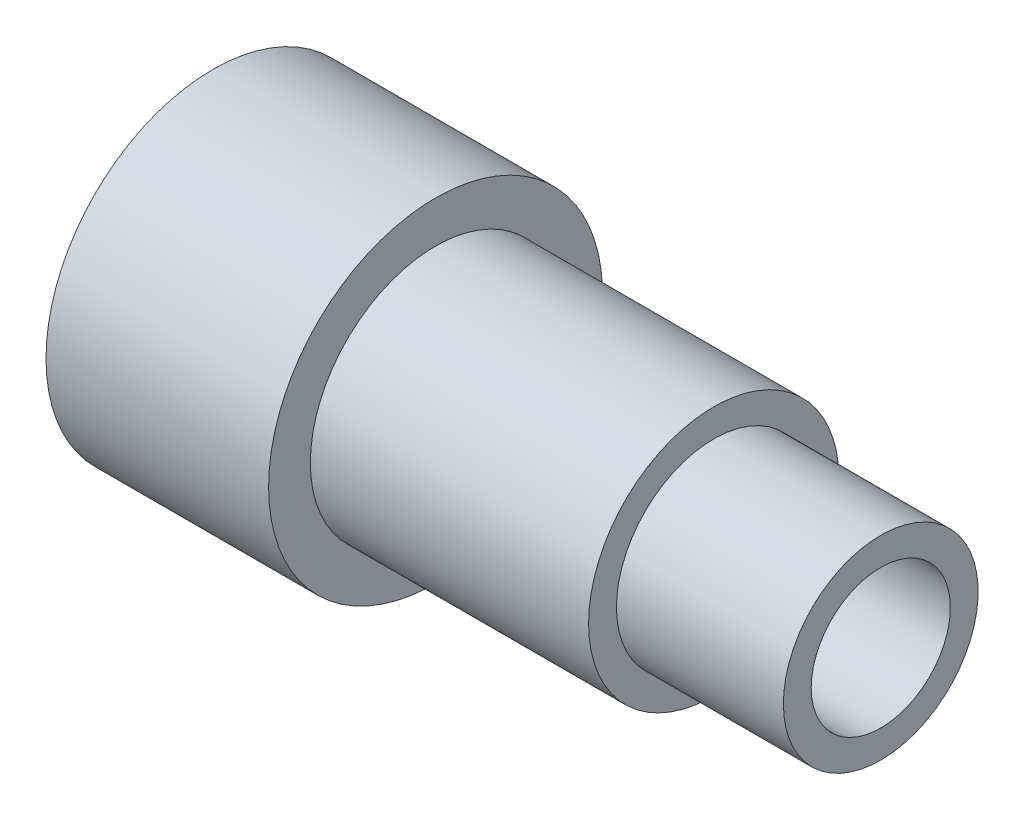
ISO-10303-21;
HEADER;
FILE_DESCRIPTION(('STEP AP214'),'2;1');
FILE_NAME('part.step','',(''),(''),'','','');
FILE_SCHEMA(('AUTOMOTIVE_DESIGN { 1 0 10303 214 1 1 1 1 }'));
ENDSEC;
DATA;
#1=APPLICATION_CONTEXT('core data for automotive mechanical design processes');
#2=APPLICATION_PROTOCOL_DEFINITION('international standard','automotive_design',2000,#1);
#3=PRODUCT_CONTEXT('',#1,'mechanical');
#4=PRODUCT('Part','Part','',(#3));
#5=PRODUCT_RELATED_PRODUCT_CATEGORY('part','',(#4));
#6=PRODUCT_DEFINITION_FORMATION('','',#4);
#7=PRODUCT_DEFINITION_CONTEXT('part definition',#1,'design');
#8=PRODUCT_DEFINITION('design','',#6,#7);
#9=PRODUCT_DEFINITION_SHAPE('','',#8);
#10=(LENGTH_UNIT() NAMED_UNIT(*) SI_UNIT(.MILLI.,.METRE.));
#11=(NAMED_UNIT(*) PLANE_ANGLE_UNIT() SI_UNIT($,.RADIAN.));
#12=(NAMED_UNIT(*) SI_UNIT($,.STERADIAN.) SOLID_ANGLE_UNIT());
#13=UNCERTAINTY_MEASURE_WITH_UNIT(LENGTH_MEASURE(1.E-05),#10,'distance_accuracy_value','');
#14=(GEOMETRIC_REPRESENTATION_CONTEXT(3) GLOBAL_UNCERTAINTY_ASSIGNED_CONTEXT((#13)) GLOBAL_UNIT_ASSIGNED_CONTEXT((#10,
#11,#12)) REPRESENTATION_CONTEXT('',''));
#15=CARTESIAN_POINT('',(0.,0.,0.));
#16=DIRECTION('',(0.,0.,1.));
#17=DIRECTION('',(1.,0.,0.));
#18=AXIS2_PLACEMENT_3D('',#15,#16,#17);
#19=CARTESIAN_POINT('',(0.,0.,0.));
#20=DIRECTION('',(-1.,0.,0.));
#21=DIRECTION('',(0.,0.,1.));
#22=AXIS2_PLACEMENT_3D('',#19,#20,#21);
#23=CYLINDRICAL_SURFACE('',#22,12.5);
#24=CARTESIAN_POINT('',(65.,-12.1346610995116,3.00000000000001));
#25=CARTESIAN_POINT('',(64.8341136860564,-12.1346643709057,2.999994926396));
#26=CARTESIAN_POINT('',(64.6681696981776,-12.1380998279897,2.9861940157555));
#27=CARTESIAN_POINT('',(64.3410316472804,-12.1514386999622,2.93143372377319));
#28=CARTESIAN_POINT('',(64.179840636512,-12.1613461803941,2.89045727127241));
#29=CARTESIAN_POINT('',(63.8669877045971,-12.1864438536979,2.78273587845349));
#30=CARTESIAN_POINT('',(63.715314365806,-12.2016275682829,2.71602252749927));
#31=CARTESIAN_POINT('',(63.4253004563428,-12.2355589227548,2.55881551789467));
#32=CARTESIAN_POINT('',(63.2869601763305,-12.2543066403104,2.46832134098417));
#33=CARTESIAN_POINT('',(63.0247311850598,-12.2936793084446,2.26416092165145));
#34=CARTESIAN_POINT('',(62.9011528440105,-12.3143323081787,2.15010136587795));
#35=CARTESIAN_POINT('',(62.6746846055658,-12.3549444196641,1.90289576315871));
#36=CARTESIAN_POINT('',(62.5717965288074,-12.3749034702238,1.7697480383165));
#37=CARTESIAN_POINT('',(62.388373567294,-12.4121875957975,1.48603435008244));
#38=CARTESIAN_POINT('',(62.3081414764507,-12.429475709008,1.33526735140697));
#39=CARTESIAN_POINT('',(62.1742734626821,-12.4591511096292,1.02190364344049));
#40=CARTESIAN_POINT('',(62.1206339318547,-12.471539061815,0.859308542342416));
#41=CARTESIAN_POINT('',(62.0424618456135,-12.4898200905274,0.530137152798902));
#42=CARTESIAN_POINT('',(62.0174027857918,-12.4958305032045,0.363692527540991));
#43=CARTESIAN_POINT('',(61.9954524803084,-12.5010873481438,0.0288605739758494));
#44=CARTESIAN_POINT('',(61.9985573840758,-12.5003347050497,-0.139526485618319));
#45=CARTESIAN_POINT('',(62.032463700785,-12.4922383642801,-0.469819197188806));
#46=CARTESIAN_POINT('',(62.0626970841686,-12.4850298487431,-0.631786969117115));
#47=CARTESIAN_POINT('',(62.1490917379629,-12.4649879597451,-0.948279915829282));
#48=CARTESIAN_POINT('',(62.2052543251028,-12.4521543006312,-1.10280471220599));
#49=CARTESIAN_POINT('',(62.3423868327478,-12.4220937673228,-1.40154850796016));
#50=CARTESIAN_POINT('',(62.4235632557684,-12.4048305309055,-1.54566890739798));
#51=CARTESIAN_POINT('',(62.6082634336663,-12.3677903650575,-1.8184437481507));
#52=CARTESIAN_POINT('',(62.7117908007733,-12.3480130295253,-1.94709568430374));
#53=CARTESIAN_POINT('',(62.9413154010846,-12.307523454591,-2.18866676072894));
#54=CARTESIAN_POINT('',(63.067809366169,-12.2868002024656,-2.30111257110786));
#55=CARTESIAN_POINT('',(63.3380756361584,-12.247210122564,-2.5032955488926));
#56=CARTESIAN_POINT('',(63.4818486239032,-12.2283433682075,-2.59303181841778));
#57=CARTESIAN_POINT('',(63.7834652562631,-12.1945661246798,-2.7475198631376));
#58=CARTESIAN_POINT('',(63.9413650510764,-12.1796724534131,-2.812165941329));
#59=CARTESIAN_POINT('',(64.2662331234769,-12.155748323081,-2.91385324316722));
#60=CARTESIAN_POINT('',(64.4331996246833,-12.1467167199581,-2.95089985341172));
#61=CARTESIAN_POINT('',(64.7670933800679,-12.1357772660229,-2.99556850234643));
#62=CARTESIAN_POINT('',(64.9339220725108,-12.1337008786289,-3.00388683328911));
#63=CARTESIAN_POINT('',(65.2665831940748,-12.1364495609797,-2.99276203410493));
#64=CARTESIAN_POINT('',(65.4324157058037,-12.1412740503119,-2.97332123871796));
#65=CARTESIAN_POINT('',(65.7558459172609,-12.1571201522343,-2.90783852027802));
#66=CARTESIAN_POINT('',(65.9135291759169,-12.1680489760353,-2.86219461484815));
#67=CARTESIAN_POINT('',(66.2190078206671,-12.1947857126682,-2.74603914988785));
#68=CARTESIAN_POINT('',(66.3668021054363,-12.2105941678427,-2.67552482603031));
#69=CARTESIAN_POINT('',(66.651278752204,-12.2456689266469,-2.51014743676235));
#70=CARTESIAN_POINT('',(66.7877093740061,-12.2649930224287,-2.41486385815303));
#71=CARTESIAN_POINT('',(67.0429007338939,-12.3047764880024,-2.20319051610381));
#72=CARTESIAN_POINT('',(67.1616588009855,-12.3252360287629,-2.08679756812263));
#73=CARTESIAN_POINT('',(67.3809150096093,-12.3655511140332,-1.8330286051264));
#74=CARTESIAN_POINT('',(67.4809337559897,-12.3853821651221,-1.69523379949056));
#75=CARTESIAN_POINT('',(67.656408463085,-12.4217193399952,-1.40439761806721));
#76=CARTESIAN_POINT('',(67.7318656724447,-12.438225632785,-1.25135701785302));
#77=CARTESIAN_POINT('',(67.855447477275,-12.4659520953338,-0.93540618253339));
#78=CARTESIAN_POINT('',(67.9037623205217,-12.4772089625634,-0.772573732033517));
#79=CARTESIAN_POINT('',(67.9722678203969,-12.4933282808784,-0.440797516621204));
#80=CARTESIAN_POINT('',(67.9924634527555,-12.4981918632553,-0.271854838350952));
#81=CARTESIAN_POINT('',(68.0038958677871,-12.5009346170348,0.0628273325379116));
#82=CARTESIAN_POINT('',(67.9958427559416,-12.4989850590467,0.228541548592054));
#83=CARTESIAN_POINT('',(67.9526200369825,-12.4886960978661,0.556181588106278));
#84=CARTESIAN_POINT('',(67.9174511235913,-12.4803568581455,0.718107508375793));
#85=CARTESIAN_POINT('',(67.8213631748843,-12.4582475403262,1.0328953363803));
#86=CARTESIAN_POINT('',(67.7605634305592,-12.4445026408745,1.18579554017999));
#87=CARTESIAN_POINT('',(67.6150497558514,-12.4130357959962,1.47930912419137));
#88=CARTESIAN_POINT('',(67.5303330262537,-12.3953133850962,1.61992106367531));
#89=CARTESIAN_POINT('',(67.3371745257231,-12.3573152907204,1.88826701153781));
#90=CARTESIAN_POINT('',(67.2282449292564,-12.3369914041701,2.0156430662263));
#91=CARTESIAN_POINT('',(66.9907123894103,-12.2963112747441,2.2505495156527));
#92=CARTESIAN_POINT('',(66.8621045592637,-12.2759550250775,2.35807496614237));
#93=CARTESIAN_POINT('',(66.5862606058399,-12.2371275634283,2.55199485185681));
#94=CARTESIAN_POINT('',(66.438747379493,-12.2186938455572,2.63800316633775));
#95=CARTESIAN_POINT('',(66.1309381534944,-12.1862909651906,2.78387070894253));
#96=CARTESIAN_POINT('',(65.9706520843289,-12.1723183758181,2.8437500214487));
#97=CARTESIAN_POINT('',(65.6754071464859,-12.1527391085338,2.92614436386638));
#98=CARTESIAN_POINT('',(65.5419291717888,-12.1460087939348,2.9537823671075));
#99=CARTESIAN_POINT('',(65.2723136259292,-12.1369686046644,2.99071161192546));
#100=CARTESIAN_POINT('',(65.136176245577,-12.1346584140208,3.00000416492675));
#101=CARTESIAN_POINT('',(65.,-12.1346610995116,3.00000000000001));
#102=B_SPLINE_CURVE_WITH_KNOTS('',3,(#24,#25,#26,#27,#28,#29,#30,#31,#32,#33,#34,#35,#36,#37,
#38,#39,#40,#41,#42,#43,#44,#45,#46,#47,#48,#49,#50,#51,#52,#53,#54,#55,#56,#57,#58,#59,#60,#61,
#62,#63,#64,#65,#66,#67,#68,#69,#70,#71,#72,#73,#74,#75,#76,#77,#78,#79,#80,#81,#82,#83,#84,#85,
#86,#87,#88,#89,#90,#91,#92,#93,#94,#95,#96,#97,#98,#99,#100,#101),.UNSPECIFIED.,.T.,.F.,(4,2,2,
2,2,2,2,2,2,2,2,2,2,2,2,2,2,2,2,2,2,2,2,2,2,2,2,2,2,2,2,2,2,2,2,2,2,2,4),(0.,0.497159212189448,
0.994631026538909,1.49149417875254,1.98836816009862,2.49432418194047,3.00032470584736,
3.51279830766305,4.02520236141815,4.5280062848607,5.03074146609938,5.52318961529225,
6.0156627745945,6.51231571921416,7.00904899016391,7.51819168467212,8.02735450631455,
8.53863957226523,9.04982482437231,9.54852995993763,10.047193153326,10.5384749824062,
11.0298114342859,11.5301065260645,12.0304771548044,12.5422844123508,13.0540656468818,
13.5622134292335,14.0702712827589,14.5656502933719,15.0610166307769,15.554102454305,
16.047246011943,16.5514085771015,17.0556965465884,17.56847227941,18.0808531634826,
18.4890008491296,18.8971193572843),.UNSPECIFIED.);
#103=CARTESIAN_POINT('',(65.,-12.1346610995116,3.00000000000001));
#104=VERTEX_POINT('',#103);
#105=EDGE_CURVE('E117',#104,#104,#102,.T.);
#106=ORIENTED_EDGE('',*,*,#105,.T.);
#107=EDGE_LOOP('',(#106));
#108=FACE_BOUND('',#107,.T.);
#109=CARTESIAN_POINT('',(120.,0.,0.));
#110=DIRECTION('',(-1.,0.,0.));
#111=DIRECTION('',(0.,0.,1.));
#112=AXIS2_PLACEMENT_3D('',#109,#110,#111);
#113=CIRCLE('',#112,12.5);
#114=CARTESIAN_POINT('',(120.,0.,12.5));
#115=VERTEX_POINT('',#114);
#116=EDGE_CURVE('E121',#115,#115,#113,.T.);
#117=ORIENTED_EDGE('',*,*,#116,.F.);
#118=EDGE_LOOP('',(#117));
#119=FACE_BOUND('',#118,.T.);
#120=CARTESIAN_POINT('',(4.,0.,0.));
#121=DIRECTION('',(1.,0.,0.));
#122=DIRECTION('',(0.,0.,-1.));
#123=AXIS2_PLACEMENT_3D('',#120,#121,#122);
#124=CIRCLE('',#123,12.5);
#125=CARTESIAN_POINT('',(4.,12.5,0.));
#126=VERTEX_POINT('',#125);
#127=CARTESIAN_POINT('',(4.,9.,-8.67467578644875));
#128=VERTEX_POINT('',#127);
#129=EDGE_CURVE('E92',#126,#128,#124,.F.);
#130=ORIENTED_EDGE('',*,*,#129,.T.);
#131=DIRECTION('',(-1.,0.,0.));
#132=VECTOR('',#131,1.);
#133=CARTESIAN_POINT('',(0.,9.,-8.67467578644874));
#134=LINE('',#133,#132);
#135=CARTESIAN_POINT('',(0.,9.,-8.67467578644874));
#136=VERTEX_POINT('',#135);
#137=EDGE_CURVE('E112',#128,#136,#134,.T.);
#138=ORIENTED_EDGE('',*,*,#137,.T.);
#139=CARTESIAN_POINT('',(0.,0.,0.));
#140=DIRECTION('',(-1.,0.,0.));
#141=DIRECTION('',(0.,0.,1.));
#142=AXIS2_PLACEMENT_3D('',#139,#140,#141);
#143=CIRCLE('',#142,12.5);
#144=CARTESIAN_POINT('',(0.,12.5,0.));
#145=VERTEX_POINT('',#144);
#146=EDGE_CURVE('E145',#136,#145,#143,.T.);
#147=ORIENTED_EDGE('',*,*,#146,.T.);
#148=DIRECTION('',(-1.,0.,0.));
#149=VECTOR('',#148,1.);
#150=CARTESIAN_POINT('',(0.,12.5,0.));
#151=LINE('',#150,#149);
#152=EDGE_CURVE('E64',#126,#145,#151,.T.);
#153=ORIENTED_EDGE('',*,*,#152,.F.);
#154=EDGE_LOOP('',(#130,#138,#147,#153));
#155=FACE_BOUND('',#154,.T.);
#156=ADVANCED_FACE('F41',(#108,#119,#155),#23,.F.);
#157=CARTESIAN_POINT('',(0.,12.5,0.));
#158=DIRECTION('',(1.,0.,0.));
#159=DIRECTION('',(0.,0.,-1.));
#160=AXIS2_PLACEMENT_3D('',#157,#158,#159);
#161=PLANE('',#160);
#162=ORIENTED_EDGE('',*,*,#146,.F.);
#163=DIRECTION('',(0.,0.,-1.));
#164=VECTOR('',#163,1.);
#165=CARTESIAN_POINT('',(0.,9.,0.));
#166=LINE('',#165,#164);
#167=CARTESIAN_POINT('',(0.,9.,-28.6181760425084));
#168=VERTEX_POINT('',#167);
#169=EDGE_CURVE('E107',#136,#168,#166,.T.);
#170=ORIENTED_EDGE('',*,*,#169,.T.);
#171=CARTESIAN_POINT('',(0.,0.,0.));
#172=DIRECTION('',(-1.,0.,0.));
#173=DIRECTION('',(0.,0.,1.));
#174=AXIS2_PLACEMENT_3D('',#171,#172,#173);
#175=CIRCLE('',#174,30.);
#176=CARTESIAN_POINT('',(0.,17.,-24.7184141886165));
#177=VERTEX_POINT('',#176);
#178=EDGE_CURVE('E174',#168,#177,#175,.T.);
#179=ORIENTED_EDGE('',*,*,#178,.T.);
#180=DIRECTION('',(0.,0.,1.));
#181=VECTOR('',#180,1.);
#182=CARTESIAN_POINT('',(0.,17.,0.));
#183=LINE('',#182,#181);
#184=CARTESIAN_POINT('',(0.,17.,0.));
#185=VERTEX_POINT('',#184);
#186=EDGE_CURVE('E57',#177,#185,#183,.T.);
#187=ORIENTED_EDGE('',*,*,#186,.T.);
#188=DIRECTION('',(0.,1.,0.));
#189=VECTOR('',#188,1.);
#190=CARTESIAN_POINT('',(0.,12.5,0.));
#191=LINE('',#190,#189);
#192=EDGE_CURVE('E11',#145,#185,#191,.T.);
#193=ORIENTED_EDGE('',*,*,#192,.F.);
#194=EDGE_LOOP('',(#162,#170,#179,#187,#193));
#195=FACE_BOUND('',#194,.T.);
#196=ADVANCED_FACE('F159',(#195),#161,.F.);
#197=CARTESIAN_POINT('',(0.,0.,0.));
#198=DIRECTION('',(-1.,0.,0.));
#199=DIRECTION('',(0.,0.,1.));
#200=AXIS2_PLACEMENT_3D('',#197,#198,#199);
#201=CYLINDRICAL_SURFACE('',#200,30.);
#202=ORIENTED_EDGE('',*,*,#178,.F.);
#203=DIRECTION('',(-1.,0.,0.));
#204=VECTOR('',#203,1.);
#205=CARTESIAN_POINT('',(0.,9.,-28.6181760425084));
#206=LINE('',#205,#204);
#207=CARTESIAN_POINT('',(4.,9.,-28.6181760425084));
#208=VERTEX_POINT('',#207);
#209=EDGE_CURVE('E47',#168,#208,#206,.F.);
#210=ORIENTED_EDGE('',*,*,#209,.T.);
#211=CARTESIAN_POINT('',(4.,0.,0.));
#212=DIRECTION('',(1.,0.,0.));
#213=DIRECTION('',(0.,0.,-1.));
#214=AXIS2_PLACEMENT_3D('',#211,#212,#213);
#215=CIRCLE('',#214,30.);
#216=CARTESIAN_POINT('',(4.,17.,-24.7184141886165));
#217=VERTEX_POINT('',#216);
#218=EDGE_CURVE('E173',#208,#217,#215,.T.);
#219=ORIENTED_EDGE('',*,*,#218,.T.);
#220=DIRECTION('',(-1.,0.,0.));
#221=VECTOR('',#220,1.);
#222=CARTESIAN_POINT('',(0.,17.,-24.7184141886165));
#223=LINE('',#222,#221);
#224=EDGE_CURVE('E99',#217,#177,#223,.T.);
#225=ORIENTED_EDGE('',*,*,#224,.T.);
#226=EDGE_LOOP('',(#202,#210,#219,#225));
#227=FACE_BOUND('',#226,.T.);
#228=CARTESIAN_POINT('',(40.,0.,0.));
#229=DIRECTION('',(-1.,0.,0.));
#230=DIRECTION('',(0.,0.,1.));
#231=AXIS2_PLACEMENT_3D('',#228,#229,#230);
#232=CIRCLE('',#231,30.);
#233=CARTESIAN_POINT('',(40.,0.,30.));
#234=VERTEX_POINT('',#233);
#235=EDGE_CURVE('E175',#234,#234,#232,.T.);
#236=ORIENTED_EDGE('',*,*,#235,.T.);
#237=EDGE_LOOP('',(#236));
#238=FACE_BOUND('',#237,.T.);
#239=ADVANCED_FACE('F160',(#227,#238),#201,.T.);
#240=CARTESIAN_POINT('',(40.,30.,0.));
#241=DIRECTION('',(-1.,0.,0.));
#242=DIRECTION('',(0.,0.,1.));
#243=AXIS2_PLACEMENT_3D('',#240,#241,#242);
#244=PLANE('',#243);
#245=ORIENTED_EDGE('',*,*,#235,.F.);
#246=EDGE_LOOP('',(#245));
#247=FACE_BOUND('',#246,.T.);
#248=CARTESIAN_POINT('',(40.,0.,0.));
#249=DIRECTION('',(-1.,0.,0.));
#250=DIRECTION('',(0.,0.,1.));
#251=AXIS2_PLACEMENT_3D('',#248,#249,#250);
#252=CIRCLE('',#251,22.5);
#253=CARTESIAN_POINT('',(40.,0.,22.5));
#254=VERTEX_POINT('',#253);
#255=EDGE_CURVE('E180',#254,#254,#252,.T.);
#256=ORIENTED_EDGE('',*,*,#255,.T.);
#257=EDGE_LOOP('',(#256));
#258=FACE_BOUND('',#257,.T.);
#259=ADVANCED_FACE('F153',(#247,#258),#244,.F.);
#260=CARTESIAN_POINT('',(0.,0.,0.));
#261=DIRECTION('',(-1.,0.,0.));
#262=DIRECTION('',(0.,0.,1.));
#263=AXIS2_PLACEMENT_3D('',#260,#261,#262);
#264=CYLINDRICAL_SURFACE('',#263,22.5);
#265=CARTESIAN_POINT('',(65.,-22.2991031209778,3.00000000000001));
#266=CARTESIAN_POINT('',(65.1677057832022,-22.2991056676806,2.99999292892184));
#267=CARTESIAN_POINT('',(65.3355140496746,-22.3010154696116,2.98588990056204));
#268=CARTESIAN_POINT('',(65.6664536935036,-22.3084447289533,2.92985694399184));
#269=CARTESIAN_POINT('',(65.8295801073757,-22.3139678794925,2.88789854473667));
#270=CARTESIAN_POINT('',(66.1463170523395,-22.3279873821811,2.777419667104));
#271=CARTESIAN_POINT('',(66.2999342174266,-22.3364816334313,2.70891795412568));
#272=CARTESIAN_POINT('',(66.5934666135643,-22.3554837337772,2.5473384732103));
#273=CARTESIAN_POINT('',(66.7333840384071,-22.3659912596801,2.45426464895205));
#274=CARTESIAN_POINT('',(66.9964601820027,-22.3879106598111,2.24555055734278));
#275=CARTESIAN_POINT('',(67.1195192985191,-22.399327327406,2.1297852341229));
#276=CARTESIAN_POINT('',(67.3445243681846,-22.4217356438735,1.87924384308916));
#277=CARTESIAN_POINT('',(67.4464692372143,-22.4327272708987,1.74446679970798));
#278=CARTESIAN_POINT('',(67.6267127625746,-22.4530964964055,1.45909758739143));
#279=CARTESIAN_POINT('',(67.7049207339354,-22.4624678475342,1.30844765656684));
#280=CARTESIAN_POINT('',(67.8348892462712,-22.4784878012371,0.996005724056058));
#281=CARTESIAN_POINT('',(67.8866508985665,-22.4851365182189,0.834214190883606));
#282=CARTESIAN_POINT('',(67.9619583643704,-22.4949282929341,0.505103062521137));
#283=CARTESIAN_POINT('',(67.985670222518,-22.4980919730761,0.337822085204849));
#284=CARTESIAN_POINT('',(68.0047199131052,-22.5006277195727,0.00162750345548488));
#285=CARTESIAN_POINT('',(68.0000590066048,-22.4999999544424,-0.167286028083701));
#286=CARTESIAN_POINT('',(67.9626279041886,-22.4950401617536,-0.500820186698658));
#287=CARTESIAN_POINT('',(67.9300363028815,-22.4907316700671,-0.665461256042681));
#288=CARTESIAN_POINT('',(67.8379485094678,-22.4789208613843,-0.986916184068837));
#289=CARTESIAN_POINT('',(67.7784517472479,-22.4714184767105,-1.14372987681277));
#290=CARTESIAN_POINT('',(67.6340548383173,-22.4540222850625,-1.4456277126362));
#291=CARTESIAN_POINT('',(67.5490780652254,-22.4441212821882,-1.59067477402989));
#292=CARTESIAN_POINT('',(67.3561891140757,-22.4230342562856,-1.86451753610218));
#293=CARTESIAN_POINT('',(67.2482757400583,-22.4118481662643,-1.99331238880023));
#294=CARTESIAN_POINT('',(67.0115782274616,-22.3893388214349,-2.23204509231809));
#295=CARTESIAN_POINT('',(66.8826383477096,-22.378015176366,-2.34182855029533));
#296=CARTESIAN_POINT('',(66.6080811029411,-22.3565924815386,-2.53822039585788));
#297=CARTESIAN_POINT('',(66.4624636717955,-22.3464934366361,-2.62482869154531));
#298=CARTESIAN_POINT('',(66.15853999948,-22.3286636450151,-2.77242429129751));
#299=CARTESIAN_POINT('',(66.0002271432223,-22.3209341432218,-2.83339813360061));
#300=CARTESIAN_POINT('',(65.6754829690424,-22.3087421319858,-2.92785135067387));
#301=CARTESIAN_POINT('',(65.5090520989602,-22.3042794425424,-2.96133224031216));
#302=CARTESIAN_POINT('',(65.1741629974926,-22.2991596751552,-2.99964241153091));
#303=CARTESIAN_POINT('',(65.0057301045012,-22.2984736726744,-3.00468946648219));
#304=CARTESIAN_POINT('',(64.6704211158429,-22.3009083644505,-2.98656432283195));
#305=CARTESIAN_POINT('',(64.5035449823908,-22.3040289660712,-2.96339281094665));
#306=CARTESIAN_POINT('',(64.1767460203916,-22.3136988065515,-2.8896720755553));
#307=CARTESIAN_POINT('',(64.0167987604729,-22.3202347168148,-2.8392292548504));
#308=CARTESIAN_POINT('',(63.7076316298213,-22.3359878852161,-2.71250767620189));
#309=CARTESIAN_POINT('',(63.5584121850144,-22.3452052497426,-2.63622789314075));
#310=CARTESIAN_POINT('',(63.2739540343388,-22.3653516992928,-2.45946609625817));
#311=CARTESIAN_POINT('',(63.1388044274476,-22.376290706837,-2.35884184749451));
#312=CARTESIAN_POINT('',(62.8872335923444,-22.3986171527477,-2.13644748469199));
#313=CARTESIAN_POINT('',(62.770813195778,-22.410004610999,-2.01467643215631));
#314=CARTESIAN_POINT('',(62.5592351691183,-22.43203422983,-1.75249132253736));
#315=CARTESIAN_POINT('',(62.4642210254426,-22.4426710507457,-1.61196096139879));
#316=CARTESIAN_POINT('',(62.299147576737,-22.4619201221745,-1.31680867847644));
#317=CARTESIAN_POINT('',(62.2290877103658,-22.4705324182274,-1.16218707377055));
#318=CARTESIAN_POINT('',(62.1161461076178,-22.4847384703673,-0.843709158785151));
#319=CARTESIAN_POINT('',(62.0731828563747,-22.4903412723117,-0.679882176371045));
#320=CARTESIAN_POINT('',(62.0153892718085,-22.4979347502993,-0.347259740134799));
#321=CARTESIAN_POINT('',(62.0005574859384,-22.499925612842,-0.178464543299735));
#322=CARTESIAN_POINT('',(61.9994775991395,-22.5000697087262,0.157904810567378));
#323=CARTESIAN_POINT('',(62.0130087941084,-22.4982525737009,0.325478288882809));
#324=CARTESIAN_POINT('',(62.067801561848,-22.4910439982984,0.655946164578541));
#325=CARTESIAN_POINT('',(62.109063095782,-22.485652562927,0.818840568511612));
#326=CARTESIAN_POINT('',(62.2180730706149,-22.4718983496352,1.13528735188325));
#327=CARTESIAN_POINT('',(62.2858094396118,-22.4635369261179,1.28884395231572));
#328=CARTESIAN_POINT('',(62.4458233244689,-22.4447662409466,1.58244611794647));
#329=CARTESIAN_POINT('',(62.5381012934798,-22.4343569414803,1.72249143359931));
#330=CARTESIAN_POINT('',(62.7453900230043,-22.4125543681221,1.98622092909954));
#331=CARTESIAN_POINT('',(62.8605646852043,-22.4011543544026,2.10977573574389));
#332=CARTESIAN_POINT('',(63.1100346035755,-22.3787079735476,2.33588843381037));
#333=CARTESIAN_POINT('',(63.2443343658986,-22.3676616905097,2.43844136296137));
#334=CARTESIAN_POINT('',(63.5289259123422,-22.3471216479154,2.62003186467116));
#335=CARTESIAN_POINT('',(63.6792853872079,-22.337634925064,2.69896410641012));
#336=CARTESIAN_POINT('',(63.9911727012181,-22.3213704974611,2.83034277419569));
#337=CARTESIAN_POINT('',(64.1526883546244,-22.3145898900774,2.8828175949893));
#338=CARTESIAN_POINT('',(64.4291724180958,-22.3061270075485,2.94743220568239));
#339=CARTESIAN_POINT('',(64.5424074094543,-22.3035064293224,2.96711622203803));
#340=CARTESIAN_POINT('',(64.7704122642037,-22.2999936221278,2.99340248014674));
#341=CARTESIAN_POINT('',(64.8851821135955,-22.2991013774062,3.00000484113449));
#342=CARTESIAN_POINT('',(65.,-22.2991031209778,3.00000000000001));
#343=B_SPLINE_CURVE_WITH_KNOTS('',3,(#265,#266,#267,#268,#269,#270,#271,#272,#273,#274,#275,
#276,#277,#278,#279,#280,#281,#282,#283,#284,#285,#286,#287,#288,#289,#290,#291,#292,#293,#294,
#295,#296,#297,#298,#299,#300,#301,#302,#303,#304,#305,#306,#307,#308,#309,#310,#311,#312,#313,
#314,#315,#316,#317,#318,#319,#320,#321,#322,#323,#324,#325,#326,#327,#328,#329,#330,#331,#332,
#333,#334,#335,#336,#337,#338,#339,#340,#341,#342),.UNSPECIFIED.,.T.,.F.,(4,2,2,2,2,2,2,2,2,2,2,
2,2,2,2,2,2,2,2,2,2,2,2,2,2,2,2,2,2,2,2,2,2,2,2,2,2,2,4),(0.,0.502697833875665,1.00591026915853,
1.50876759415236,2.01154426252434,2.51717392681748,3.02282954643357,3.5303933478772,
4.03793581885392,4.54245854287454,5.04695884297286,5.5482571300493,6.04956604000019,
6.55239792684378,7.05525603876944,7.56202372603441,8.06879342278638,8.57582891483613,
9.08283646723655,9.58595553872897,10.0890623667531,10.5902202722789,11.0913980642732,
11.595577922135,12.0997801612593,12.6072676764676,13.1147437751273,13.6206858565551,
14.1266018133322,14.6285956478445,15.1305887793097,15.632353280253,16.1341270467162,
16.6396311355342,17.1452545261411,17.6531001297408,18.160399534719,18.5045691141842,
18.8487355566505),.UNSPECIFIED.);
#344=CARTESIAN_POINT('',(65.,-22.2991031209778,3.00000000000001));
#345=VERTEX_POINT('',#344);
#346=EDGE_CURVE('E116',#345,#345,#343,.T.);
#347=ORIENTED_EDGE('',*,*,#346,.T.);
#348=EDGE_LOOP('',(#347));
#349=FACE_BOUND('',#348,.T.);
#350=ORIENTED_EDGE('',*,*,#255,.F.);
#351=EDGE_LOOP('',(#350));
#352=FACE_BOUND('',#351,.T.);
#353=CARTESIAN_POINT('',(90.,0.,0.));
#354=DIRECTION('',(-1.,0.,0.));
#355=DIRECTION('',(0.,0.,1.));
#356=AXIS2_PLACEMENT_3D('',#353,#354,#355);
#357=CIRCLE('',#356,22.5);
#358=CARTESIAN_POINT('',(90.,0.,22.5));
#359=VERTEX_POINT('',#358);
#360=EDGE_CURVE('E185',#359,#359,#357,.T.);
#361=ORIENTED_EDGE('',*,*,#360,.T.);
#362=EDGE_LOOP('',(#361));
#363=FACE_BOUND('',#362,.T.);
#364=ADVANCED_FACE('F150',(#349,#352,#363),#264,.T.);
#365=CARTESIAN_POINT('',(90.,22.5,0.));
#366=DIRECTION('',(-1.,0.,0.));
#367=DIRECTION('',(0.,0.,1.));
#368=AXIS2_PLACEMENT_3D('',#365,#366,#367);
#369=PLANE('',#368);
#370=ORIENTED_EDGE('',*,*,#360,.F.);
#371=EDGE_LOOP('',(#370));
#372=FACE_BOUND('',#371,.T.);
#373=CARTESIAN_POINT('',(90.,0.,0.));
#374=DIRECTION('',(-1.,0.,0.));
#375=DIRECTION('',(0.,0.,1.));
#376=AXIS2_PLACEMENT_3D('',#373,#374,#375);
#377=CIRCLE('',#376,17.5);
#378=CARTESIAN_POINT('',(90.,0.,17.5));
#379=VERTEX_POINT('',#378);
#380=EDGE_CURVE('E183',#379,#379,#377,.T.);
#381=ORIENTED_EDGE('',*,*,#380,.T.);
#382=EDGE_LOOP('',(#381));
#383=FACE_BOUND('',#382,.T.);
#384=ADVANCED_FACE('F155',(#372,#383),#369,.F.);
#385=CARTESIAN_POINT('',(0.,0.,0.));
#386=DIRECTION('',(-1.,0.,0.));
#387=DIRECTION('',(0.,0.,1.));
#388=AXIS2_PLACEMENT_3D('',#385,#386,#387);
#389=CYLINDRICAL_SURFACE('',#388,17.5);
#390=ORIENTED_EDGE('',*,*,#380,.F.);
#391=EDGE_LOOP('',(#390));
#392=FACE_BOUND('',#391,.T.);
#393=CARTESIAN_POINT('',(120.,0.,0.));
#394=DIRECTION('',(-1.,0.,0.));
#395=DIRECTION('',(0.,0.,1.));
#396=AXIS2_PLACEMENT_3D('',#393,#394,#395);
#397=CIRCLE('',#396,17.5);
#398=CARTESIAN_POINT('',(120.,0.,17.5));
#399=VERTEX_POINT('',#398);
#400=EDGE_CURVE('E187',#399,#399,#397,.T.);
#401=ORIENTED_EDGE('',*,*,#400,.T.);
#402=EDGE_LOOP('',(#401));
#403=FACE_BOUND('',#402,.T.);
#404=ADVANCED_FACE('F207',(#392,#403),#389,.T.);
#405=CARTESIAN_POINT('',(120.,17.5,0.));
#406=DIRECTION('',(-1.,0.,0.));
#407=DIRECTION('',(0.,0.,1.));
#408=AXIS2_PLACEMENT_3D('',#405,#406,#407);
#409=PLANE('',#408);
#410=ORIENTED_EDGE('',*,*,#400,.F.);
#411=EDGE_LOOP('',(#410));
#412=FACE_BOUND('',#411,.T.);
#413=ORIENTED_EDGE('',*,*,#116,.T.);
#414=EDGE_LOOP('',(#413));
#415=FACE_BOUND('',#414,.T.);
#416=ADVANCED_FACE('F131',(#412,#415),#409,.F.);
#417=CARTESIAN_POINT('',(65.,-30.,0.));
#418=DIRECTION('',(0.,1.,0.));
#419=DIRECTION('',(0.,0.,1.));
#420=AXIS2_PLACEMENT_3D('',#417,#418,#419);
#421=CYLINDRICAL_SURFACE('',#420,3.00000000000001);
#422=ORIENTED_EDGE('',*,*,#346,.F.);
#423=EDGE_LOOP('',(#422));
#424=FACE_BOUND('',#423,.T.);
#425=ORIENTED_EDGE('',*,*,#105,.F.);
#426=EDGE_LOOP('',(#425));
#427=FACE_BOUND('',#426,.T.);
#428=ADVANCED_FACE('F127',(#424,#427),#421,.F.);
#429=CARTESIAN_POINT('',(0.,0.,0.));
#430=DIRECTION('',(0.,0.,-1.));
#431=DIRECTION('',(-1.,0.,0.));
#432=AXIS2_PLACEMENT_3D('',#429,#430,#431);
#433=PLANE('',#432);
#434=ORIENTED_EDGE('',*,*,#152,.T.);
#435=ORIENTED_EDGE('',*,*,#192,.T.);
#436=DIRECTION('',(-1.,0.,0.));
#437=VECTOR('',#436,1.);
#438=CARTESIAN_POINT('',(-4.,17.,0.));
#439=LINE('',#438,#437);
#440=CARTESIAN_POINT('',(4.,17.,0.));
#441=VERTEX_POINT('',#440);
#442=EDGE_CURVE('E100',#441,#185,#439,.T.);
#443=ORIENTED_EDGE('',*,*,#442,.F.);
#444=DIRECTION('',(0.,1.,0.));
#445=VECTOR('',#444,1.);
#446=CARTESIAN_POINT('',(4.,9.,0.));
#447=LINE('',#446,#445);
#448=EDGE_CURVE('E86',#126,#441,#447,.T.);
#449=ORIENTED_EDGE('',*,*,#448,.F.);
#450=EDGE_LOOP('',(#434,#435,#443,#449));
#451=FACE_BOUND('',#450,.T.);
#452=ADVANCED_FACE('F103',(#451),#433,.T.);
#453=CARTESIAN_POINT('',(4.,9.,-130.));
#454=DIRECTION('',(1.,0.,0.));
#455=DIRECTION('',(0.,0.,-1.));
#456=AXIS2_PLACEMENT_3D('',#453,#454,#455);
#457=PLANE('',#456);
#458=ORIENTED_EDGE('',*,*,#448,.T.);
#459=DIRECTION('',(0.,0.,1.));
#460=VECTOR('',#459,1.);
#461=CARTESIAN_POINT('',(4.,17.,-130.));
#462=LINE('',#461,#460);
#463=EDGE_CURVE('E93',#217,#441,#462,.T.);
#464=ORIENTED_EDGE('',*,*,#463,.F.);
#465=ORIENTED_EDGE('',*,*,#218,.F.);
#466=DIRECTION('',(0.,0.,1.));
#467=VECTOR('',#466,1.);
#468=CARTESIAN_POINT('',(4.,9.,-130.));
#469=LINE('',#468,#467);
#470=EDGE_CURVE('E101',#208,#128,#469,.T.);
#471=ORIENTED_EDGE('',*,*,#470,.T.);
#472=ORIENTED_EDGE('',*,*,#129,.F.);
#473=EDGE_LOOP('',(#458,#464,#465,#471,#472));
#474=FACE_BOUND('',#473,.T.);
#475=ADVANCED_FACE('F89',(#474),#457,.F.);
#476=CARTESIAN_POINT('',(-4.,9.,-130.));
#477=DIRECTION('',(0.,-1.,0.));
#478=DIRECTION('',(0.,0.,-1.));
#479=AXIS2_PLACEMENT_3D('',#476,#477,#478);
#480=PLANE('',#479);
#481=ORIENTED_EDGE('',*,*,#470,.F.);
#482=ORIENTED_EDGE('',*,*,#209,.F.);
#483=ORIENTED_EDGE('',*,*,#169,.F.);
#484=ORIENTED_EDGE('',*,*,#137,.F.);
#485=EDGE_LOOP('',(#481,#482,#483,#484));
#486=FACE_BOUND('',#485,.T.);
#487=ADVANCED_FACE('F197',(#486),#480,.F.);
#488=CARTESIAN_POINT('',(-4.,17.,-130.));
#489=DIRECTION('',(0.,1.,0.));
#490=DIRECTION('',(0.,0.,1.));
#491=AXIS2_PLACEMENT_3D('',#488,#489,#490);
#492=PLANE('',#491);
#493=ORIENTED_EDGE('',*,*,#224,.F.);
#494=ORIENTED_EDGE('',*,*,#463,.T.);
#495=ORIENTED_EDGE('',*,*,#442,.T.);
#496=ORIENTED_EDGE('',*,*,#186,.F.);
#497=EDGE_LOOP('',(#493,#494,#495,#496));
#498=FACE_BOUND('',#497,.T.);
#499=ADVANCED_FACE('F97',(#498),#492,.F.);
#500=CLOSED_SHELL('',(#156,#196,#239,#259,#364,#384,#404,#416,#428,#452,#475,#487,#499));
#501=MANIFOLD_SOLID_BREP('B2',#500);
#502=ADVANCED_BREP_SHAPE_REPRESENTATION('',(#18,#501),#14);
#503=SHAPE_DEFINITION_REPRESENTATION(#9,#502);
ENDSEC;
END-ISO-10303-21;
